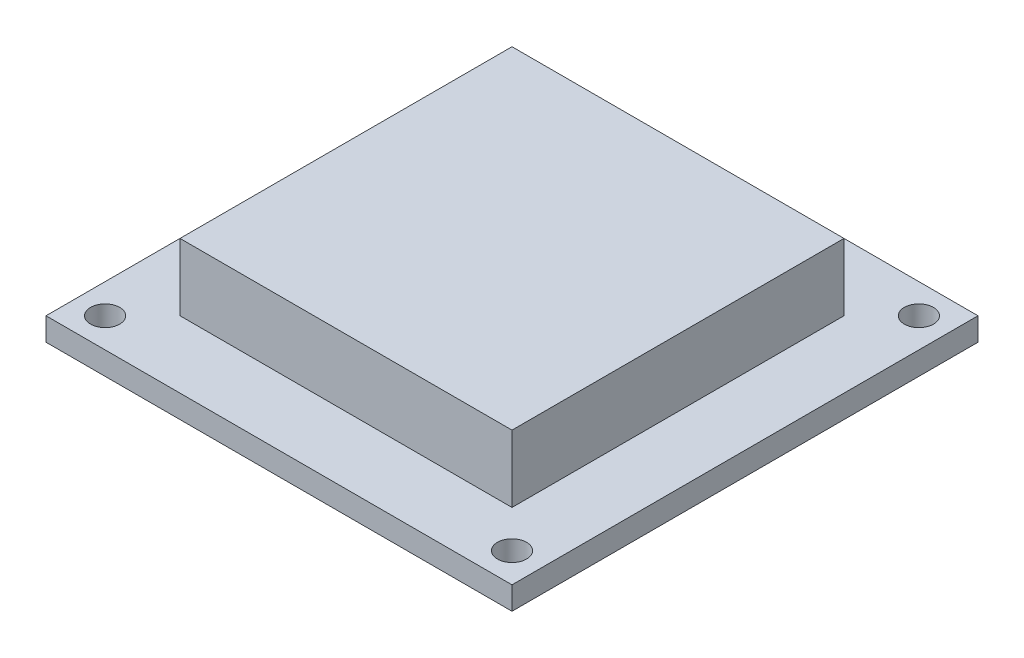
ISO-10303-21;
HEADER;
FILE_DESCRIPTION(('STEP AP214'),'2;1');
FILE_NAME('part.step','',(''),(''),'','','');
FILE_SCHEMA(('AUTOMOTIVE_DESIGN { 1 0 10303 214 1 1 1 1 }'));
ENDSEC;
DATA;
#1=APPLICATION_CONTEXT('core data for automotive mechanical design processes');
#2=APPLICATION_PROTOCOL_DEFINITION('international standard','automotive_design',2000,#1);
#3=PRODUCT_CONTEXT('',#1,'mechanical');
#4=PRODUCT('Part','Part','',(#3));
#5=PRODUCT_RELATED_PRODUCT_CATEGORY('part','',(#4));
#6=PRODUCT_DEFINITION_FORMATION('','',#4);
#7=PRODUCT_DEFINITION_CONTEXT('part definition',#1,'design');
#8=PRODUCT_DEFINITION('design','',#6,#7);
#9=PRODUCT_DEFINITION_SHAPE('','',#8);
#10=(LENGTH_UNIT() NAMED_UNIT(*) SI_UNIT(.MILLI.,.METRE.));
#11=(NAMED_UNIT(*) PLANE_ANGLE_UNIT() SI_UNIT($,.RADIAN.));
#12=(NAMED_UNIT(*) SI_UNIT($,.STERADIAN.) SOLID_ANGLE_UNIT());
#13=UNCERTAINTY_MEASURE_WITH_UNIT(LENGTH_MEASURE(1.E-05),#10,'distance_accuracy_value','');
#14=(GEOMETRIC_REPRESENTATION_CONTEXT(3) GLOBAL_UNCERTAINTY_ASSIGNED_CONTEXT((#13)) GLOBAL_UNIT_ASSIGNED_CONTEXT((#10,
#11,#12)) REPRESENTATION_CONTEXT('',''));
#15=CARTESIAN_POINT('',(0.,0.,0.));
#16=DIRECTION('',(0.,0.,1.));
#17=DIRECTION('',(1.,0.,0.));
#18=AXIS2_PLACEMENT_3D('',#15,#16,#17);
#19=CARTESIAN_POINT('',(0.,0.7874,0.));
#20=DIRECTION('',(0.,-1.,0.));
#21=DIRECTION('',(0.,0.,-1.));
#22=AXIS2_PLACEMENT_3D('',#19,#20,#21);
#23=PLANE('',#22);
#24=CARTESIAN_POINT('',(-6.985,0.7874,6.985));
#25=DIRECTION('',(0.,-1.,0.));
#26=DIRECTION('',(0.,0.,-1.));
#27=AXIS2_PLACEMENT_3D('',#24,#25,#26);
#28=CIRCLE('',#27,0.500000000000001);
#29=CARTESIAN_POINT('',(-6.985,0.7874,6.485));
#30=VERTEX_POINT('',#29);
#31=EDGE_CURVE('E307',#30,#30,#28,.T.);
#32=ORIENTED_EDGE('',*,*,#31,.T.);
#33=EDGE_LOOP('',(#32));
#34=FACE_BOUND('',#33,.T.);
#35=CARTESIAN_POINT('',(6.985,0.7874,6.985));
#36=DIRECTION('',(0.,-1.,0.));
#37=DIRECTION('',(0.,0.,-1.));
#38=AXIS2_PLACEMENT_3D('',#35,#36,#37);
#39=CIRCLE('',#38,0.500000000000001);
#40=CARTESIAN_POINT('',(6.985,0.7874,6.485));
#41=VERTEX_POINT('',#40);
#42=EDGE_CURVE('E311',#41,#41,#39,.T.);
#43=ORIENTED_EDGE('',*,*,#42,.T.);
#44=EDGE_LOOP('',(#43));
#45=FACE_BOUND('',#44,.T.);
#46=CARTESIAN_POINT('',(6.985,0.7874,-6.985));
#47=DIRECTION('',(0.,-1.,0.));
#48=DIRECTION('',(0.,0.,-1.));
#49=AXIS2_PLACEMENT_3D('',#46,#47,#48);
#50=CIRCLE('',#49,0.500000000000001);
#51=CARTESIAN_POINT('',(6.985,0.7874,-7.485));
#52=VERTEX_POINT('',#51);
#53=EDGE_CURVE('E320',#52,#52,#50,.T.);
#54=ORIENTED_EDGE('',*,*,#53,.T.);
#55=EDGE_LOOP('',(#54));
#56=FACE_BOUND('',#55,.T.);
#57=CARTESIAN_POINT('',(-6.985,0.7874,-6.985));
#58=DIRECTION('',(0.,-1.,0.));
#59=DIRECTION('',(0.,0.,-1.));
#60=AXIS2_PLACEMENT_3D('',#57,#58,#59);
#61=CIRCLE('',#60,0.500000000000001);
#62=CARTESIAN_POINT('',(-6.985,0.7874,-7.485));
#63=VERTEX_POINT('',#62);
#64=EDGE_CURVE('E326',#63,#63,#61,.T.);
#65=ORIENTED_EDGE('',*,*,#64,.T.);
#66=EDGE_LOOP('',(#65));
#67=FACE_BOUND('',#66,.T.);
#68=DIRECTION('',(0.,0.,1.));
#69=VECTOR('',#68,1.);
#70=CARTESIAN_POINT('',(-8.,0.7874,-8.));
#71=LINE('',#70,#69);
#72=CARTESIAN_POINT('',(-8.,0.7874,-8.));
#73=VERTEX_POINT('',#72);
#74=CARTESIAN_POINT('',(-8.,0.7874,8.));
#75=VERTEX_POINT('',#74);
#76=EDGE_CURVE('E128',#73,#75,#71,.T.);
#77=ORIENTED_EDGE('',*,*,#76,.T.);
#78=DIRECTION('',(1.,0.,0.));
#79=VECTOR('',#78,1.);
#80=CARTESIAN_POINT('',(8.,0.7874,8.));
#81=LINE('',#80,#79);
#82=CARTESIAN_POINT('',(8.,0.7874,8.));
#83=VERTEX_POINT('',#82);
#84=EDGE_CURVE('E131',#75,#83,#81,.T.);
#85=ORIENTED_EDGE('',*,*,#84,.T.);
#86=DIRECTION('',(0.,0.,-1.));
#87=VECTOR('',#86,1.);
#88=CARTESIAN_POINT('',(8.,0.7874,-8.));
#89=LINE('',#88,#87);
#90=CARTESIAN_POINT('',(8.,0.7874,-8.));
#91=VERTEX_POINT('',#90);
#92=EDGE_CURVE('E134',#83,#91,#89,.T.);
#93=ORIENTED_EDGE('',*,*,#92,.T.);
#94=DIRECTION('',(-1.,0.,0.));
#95=VECTOR('',#94,1.);
#96=CARTESIAN_POINT('',(8.,0.7874,-8.));
#97=LINE('',#96,#95);
#98=EDGE_CURVE('E136',#91,#73,#97,.T.);
#99=ORIENTED_EDGE('',*,*,#98,.T.);
#100=EDGE_LOOP('',(#77,#85,#93,#99));
#101=FACE_BOUND('',#100,.T.);
#102=DIRECTION('',(0.,0.,1.));
#103=VECTOR('',#102,1.);
#104=CARTESIAN_POINT('',(-5.7,0.7874,-5.7));
#105=LINE('',#104,#103);
#106=CARTESIAN_POINT('',(-5.7,0.7874,-5.7));
#107=VERTEX_POINT('',#106);
#108=CARTESIAN_POINT('',(-5.7,0.7874,5.7));
#109=VERTEX_POINT('',#108);
#110=EDGE_CURVE('E118',#107,#109,#105,.T.);
#111=ORIENTED_EDGE('',*,*,#110,.F.);
#112=DIRECTION('',(-1.,0.,0.));
#113=VECTOR('',#112,1.);
#114=CARTESIAN_POINT('',(5.7,0.7874,-5.7));
#115=LINE('',#114,#113);
#116=CARTESIAN_POINT('',(5.7,0.7874,-5.7));
#117=VERTEX_POINT('',#116);
#118=EDGE_CURVE('E115',#117,#107,#115,.T.);
#119=ORIENTED_EDGE('',*,*,#118,.F.);
#120=DIRECTION('',(0.,0.,-1.));
#121=VECTOR('',#120,1.);
#122=CARTESIAN_POINT('',(5.7,0.7874,-5.7));
#123=LINE('',#122,#121);
#124=CARTESIAN_POINT('',(5.7,0.7874,5.7));
#125=VERTEX_POINT('',#124);
#126=EDGE_CURVE('E53',#125,#117,#123,.T.);
#127=ORIENTED_EDGE('',*,*,#126,.F.);
#128=DIRECTION('',(1.,0.,0.));
#129=VECTOR('',#128,1.);
#130=CARTESIAN_POINT('',(5.7,0.7874,5.7));
#131=LINE('',#130,#129);
#132=EDGE_CURVE('E48',#109,#125,#131,.T.);
#133=ORIENTED_EDGE('',*,*,#132,.F.);
#134=EDGE_LOOP('',(#111,#119,#127,#133));
#135=FACE_BOUND('',#134,.T.);
#136=ADVANCED_FACE('F33',(#34,#45,#56,#67,#101,#135),#23,.F.);
#137=CARTESIAN_POINT('',(-8.,0.7874,-8.));
#138=DIRECTION('',(1.,0.,0.));
#139=DIRECTION('',(0.,0.,-1.));
#140=AXIS2_PLACEMENT_3D('',#137,#138,#139);
#141=PLANE('',#140);
#142=DIRECTION('',(0.,0.,1.));
#143=VECTOR('',#142,1.);
#144=CARTESIAN_POINT('',(-8.,0.,-8.));
#145=LINE('',#144,#143);
#146=CARTESIAN_POINT('',(-8.,0.,-8.));
#147=VERTEX_POINT('',#146);
#148=CARTESIAN_POINT('',(-8.,0.,8.));
#149=VERTEX_POINT('',#148);
#150=EDGE_CURVE('E119',#147,#149,#145,.T.);
#151=ORIENTED_EDGE('',*,*,#150,.T.);
#152=DIRECTION('',(0.,-1.,0.));
#153=VECTOR('',#152,1.);
#154=CARTESIAN_POINT('',(-8.,0.7874,8.));
#155=LINE('',#154,#153);
#156=EDGE_CURVE('E11',#75,#149,#155,.T.);
#157=ORIENTED_EDGE('',*,*,#156,.F.);
#158=ORIENTED_EDGE('',*,*,#76,.F.);
#159=DIRECTION('',(0.,-1.,0.));
#160=VECTOR('',#159,1.);
#161=CARTESIAN_POINT('',(-8.,0.7874,-8.));
#162=LINE('',#161,#160);
#163=EDGE_CURVE('E137',#73,#147,#162,.T.);
#164=ORIENTED_EDGE('',*,*,#163,.T.);
#165=EDGE_LOOP('',(#151,#157,#158,#164));
#166=FACE_BOUND('',#165,.T.);
#167=ADVANCED_FACE('F35',(#166),#141,.F.);
#168=CARTESIAN_POINT('',(8.,0.7874,8.));
#169=DIRECTION('',(0.,0.,-1.));
#170=DIRECTION('',(-1.,0.,0.));
#171=AXIS2_PLACEMENT_3D('',#168,#169,#170);
#172=PLANE('',#171);
#173=DIRECTION('',(1.,0.,0.));
#174=VECTOR('',#173,1.);
#175=CARTESIAN_POINT('',(8.,0.,8.));
#176=LINE('',#175,#174);
#177=CARTESIAN_POINT('',(8.,0.,8.));
#178=VERTEX_POINT('',#177);
#179=EDGE_CURVE('E122',#149,#178,#176,.T.);
#180=ORIENTED_EDGE('',*,*,#179,.T.);
#181=DIRECTION('',(0.,-1.,0.));
#182=VECTOR('',#181,1.);
#183=CARTESIAN_POINT('',(8.,0.7874,8.));
#184=LINE('',#183,#182);
#185=EDGE_CURVE('E41',#83,#178,#184,.T.);
#186=ORIENTED_EDGE('',*,*,#185,.F.);
#187=ORIENTED_EDGE('',*,*,#84,.F.);
#188=ORIENTED_EDGE('',*,*,#156,.T.);
#189=EDGE_LOOP('',(#180,#186,#187,#188));
#190=FACE_BOUND('',#189,.T.);
#191=ADVANCED_FACE('F167',(#190),#172,.F.);
#192=CARTESIAN_POINT('',(8.,0.7874,-8.));
#193=DIRECTION('',(-1.,0.,0.));
#194=DIRECTION('',(0.,0.,1.));
#195=AXIS2_PLACEMENT_3D('',#192,#193,#194);
#196=PLANE('',#195);
#197=DIRECTION('',(0.,0.,-1.));
#198=VECTOR('',#197,1.);
#199=CARTESIAN_POINT('',(8.,0.,-8.));
#200=LINE('',#199,#198);
#201=CARTESIAN_POINT('',(8.,0.,-8.));
#202=VERTEX_POINT('',#201);
#203=EDGE_CURVE('E140',#178,#202,#200,.T.);
#204=ORIENTED_EDGE('',*,*,#203,.T.);
#205=DIRECTION('',(0.,-1.,0.));
#206=VECTOR('',#205,1.);
#207=CARTESIAN_POINT('',(8.,0.7874,-8.));
#208=LINE('',#207,#206);
#209=EDGE_CURVE('E145',#91,#202,#208,.T.);
#210=ORIENTED_EDGE('',*,*,#209,.F.);
#211=ORIENTED_EDGE('',*,*,#92,.F.);
#212=ORIENTED_EDGE('',*,*,#185,.T.);
#213=EDGE_LOOP('',(#204,#210,#211,#212));
#214=FACE_BOUND('',#213,.T.);
#215=ADVANCED_FACE('F152',(#214),#196,.F.);
#216=CARTESIAN_POINT('',(8.,0.7874,-8.));
#217=DIRECTION('',(0.,0.,1.));
#218=DIRECTION('',(1.,0.,0.));
#219=AXIS2_PLACEMENT_3D('',#216,#217,#218);
#220=PLANE('',#219);
#221=DIRECTION('',(-1.,0.,0.));
#222=VECTOR('',#221,1.);
#223=CARTESIAN_POINT('',(8.,0.,-8.));
#224=LINE('',#223,#222);
#225=EDGE_CURVE('E132',#202,#147,#224,.T.);
#226=ORIENTED_EDGE('',*,*,#225,.T.);
#227=ORIENTED_EDGE('',*,*,#163,.F.);
#228=ORIENTED_EDGE('',*,*,#98,.F.);
#229=ORIENTED_EDGE('',*,*,#209,.T.);
#230=EDGE_LOOP('',(#226,#227,#228,#229));
#231=FACE_BOUND('',#230,.T.);
#232=ADVANCED_FACE('F161',(#231),#220,.F.);
#233=CARTESIAN_POINT('',(0.,0.,0.));
#234=DIRECTION('',(0.,-1.,0.));
#235=DIRECTION('',(0.,0.,-1.));
#236=AXIS2_PLACEMENT_3D('',#233,#234,#235);
#237=PLANE('',#236);
#238=CARTESIAN_POINT('',(-6.985,0.,6.985));
#239=DIRECTION('',(0.,-1.,0.));
#240=DIRECTION('',(0.,0.,-1.));
#241=AXIS2_PLACEMENT_3D('',#238,#239,#240);
#242=CIRCLE('',#241,0.500000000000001);
#243=CARTESIAN_POINT('',(-6.985,0.,6.485));
#244=VERTEX_POINT('',#243);
#245=EDGE_CURVE('E305',#244,#244,#242,.T.);
#246=ORIENTED_EDGE('',*,*,#245,.F.);
#247=EDGE_LOOP('',(#246));
#248=FACE_BOUND('',#247,.T.);
#249=CARTESIAN_POINT('',(6.985,0.,6.985));
#250=DIRECTION('',(0.,-1.,0.));
#251=DIRECTION('',(0.,0.,-1.));
#252=AXIS2_PLACEMENT_3D('',#249,#250,#251);
#253=CIRCLE('',#252,0.500000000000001);
#254=CARTESIAN_POINT('',(6.985,0.,6.485));
#255=VERTEX_POINT('',#254);
#256=EDGE_CURVE('E308',#255,#255,#253,.T.);
#257=ORIENTED_EDGE('',*,*,#256,.F.);
#258=EDGE_LOOP('',(#257));
#259=FACE_BOUND('',#258,.T.);
#260=CARTESIAN_POINT('',(6.985,0.,-6.985));
#261=DIRECTION('',(0.,-1.,0.));
#262=DIRECTION('',(0.,0.,-1.));
#263=AXIS2_PLACEMENT_3D('',#260,#261,#262);
#264=CIRCLE('',#263,0.500000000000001);
#265=CARTESIAN_POINT('',(6.985,0.,-7.485));
#266=VERTEX_POINT('',#265);
#267=EDGE_CURVE('E317',#266,#266,#264,.T.);
#268=ORIENTED_EDGE('',*,*,#267,.F.);
#269=EDGE_LOOP('',(#268));
#270=FACE_BOUND('',#269,.T.);
#271=CARTESIAN_POINT('',(-6.985,0.,-6.985));
#272=DIRECTION('',(0.,-1.,0.));
#273=DIRECTION('',(0.,0.,-1.));
#274=AXIS2_PLACEMENT_3D('',#271,#272,#273);
#275=CIRCLE('',#274,0.500000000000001);
#276=CARTESIAN_POINT('',(-6.985,0.,-7.485));
#277=VERTEX_POINT('',#276);
#278=EDGE_CURVE('E323',#277,#277,#275,.T.);
#279=ORIENTED_EDGE('',*,*,#278,.F.);
#280=EDGE_LOOP('',(#279));
#281=FACE_BOUND('',#280,.T.);
#282=ORIENTED_EDGE('',*,*,#150,.F.);
#283=ORIENTED_EDGE('',*,*,#225,.F.);
#284=ORIENTED_EDGE('',*,*,#203,.F.);
#285=ORIENTED_EDGE('',*,*,#179,.F.);
#286=EDGE_LOOP('',(#282,#283,#284,#285));
#287=FACE_BOUND('',#286,.T.);
#288=ADVANCED_FACE('F158',(#248,#259,#270,#281,#287),#237,.T.);
#289=CARTESIAN_POINT('',(-5.7,3.0874,-5.7));
#290=DIRECTION('',(1.,0.,0.));
#291=DIRECTION('',(0.,0.,-1.));
#292=AXIS2_PLACEMENT_3D('',#289,#290,#291);
#293=PLANE('',#292);
#294=ORIENTED_EDGE('',*,*,#110,.T.);
#295=DIRECTION('',(0.,-1.,0.));
#296=VECTOR('',#295,1.);
#297=CARTESIAN_POINT('',(-5.7,3.0874,5.7));
#298=LINE('',#297,#296);
#299=CARTESIAN_POINT('',(-5.7,3.0874,5.7));
#300=VERTEX_POINT('',#299);
#301=EDGE_CURVE('E99',#300,#109,#298,.T.);
#302=ORIENTED_EDGE('',*,*,#301,.F.);
#303=DIRECTION('',(0.,0.,1.));
#304=VECTOR('',#303,1.);
#305=CARTESIAN_POINT('',(-5.7,3.0874,-5.7));
#306=LINE('',#305,#304);
#307=CARTESIAN_POINT('',(-5.7,3.0874,-5.7));
#308=VERTEX_POINT('',#307);
#309=EDGE_CURVE('E106',#308,#300,#306,.T.);
#310=ORIENTED_EDGE('',*,*,#309,.F.);
#311=DIRECTION('',(0.,-1.,0.));
#312=VECTOR('',#311,1.);
#313=CARTESIAN_POINT('',(-5.7,3.0874,-5.7));
#314=LINE('',#313,#312);
#315=EDGE_CURVE('E331',#308,#107,#314,.T.);
#316=ORIENTED_EDGE('',*,*,#315,.T.);
#317=EDGE_LOOP('',(#294,#302,#310,#316));
#318=FACE_BOUND('',#317,.T.);
#319=ADVANCED_FACE('F117',(#318),#293,.F.);
#320=CARTESIAN_POINT('',(5.7,3.0874,5.7));
#321=DIRECTION('',(0.,0.,-1.));
#322=DIRECTION('',(-1.,0.,0.));
#323=AXIS2_PLACEMENT_3D('',#320,#321,#322);
#324=PLANE('',#323);
#325=ORIENTED_EDGE('',*,*,#132,.T.);
#326=DIRECTION('',(0.,-1.,0.));
#327=VECTOR('',#326,1.);
#328=CARTESIAN_POINT('',(5.7,3.0874,5.7));
#329=LINE('',#328,#327);
#330=CARTESIAN_POINT('',(5.7,3.0874,5.7));
#331=VERTEX_POINT('',#330);
#332=EDGE_CURVE('E102',#331,#125,#329,.T.);
#333=ORIENTED_EDGE('',*,*,#332,.F.);
#334=DIRECTION('',(1.,0.,0.));
#335=VECTOR('',#334,1.);
#336=CARTESIAN_POINT('',(5.7,3.0874,5.7));
#337=LINE('',#336,#335);
#338=EDGE_CURVE('E95',#300,#331,#337,.T.);
#339=ORIENTED_EDGE('',*,*,#338,.F.);
#340=ORIENTED_EDGE('',*,*,#301,.T.);
#341=EDGE_LOOP('',(#325,#333,#339,#340));
#342=FACE_BOUND('',#341,.T.);
#343=ADVANCED_FACE('F97',(#342),#324,.F.);
#344=CARTESIAN_POINT('',(5.7,3.0874,-5.7));
#345=DIRECTION('',(-1.,0.,0.));
#346=DIRECTION('',(0.,0.,1.));
#347=AXIS2_PLACEMENT_3D('',#344,#345,#346);
#348=PLANE('',#347);
#349=ORIENTED_EDGE('',*,*,#126,.T.);
#350=DIRECTION('',(0.,-1.,0.));
#351=VECTOR('',#350,1.);
#352=CARTESIAN_POINT('',(5.7,3.0874,-5.7));
#353=LINE('',#352,#351);
#354=CARTESIAN_POINT('',(5.7,3.0874,-5.7));
#355=VERTEX_POINT('',#354);
#356=EDGE_CURVE('E124',#355,#117,#353,.T.);
#357=ORIENTED_EDGE('',*,*,#356,.F.);
#358=DIRECTION('',(0.,0.,-1.));
#359=VECTOR('',#358,1.);
#360=CARTESIAN_POINT('',(5.7,3.0874,-5.7));
#361=LINE('',#360,#359);
#362=EDGE_CURVE('E105',#331,#355,#361,.T.);
#363=ORIENTED_EDGE('',*,*,#362,.F.);
#364=ORIENTED_EDGE('',*,*,#332,.T.);
#365=EDGE_LOOP('',(#349,#357,#363,#364));
#366=FACE_BOUND('',#365,.T.);
#367=ADVANCED_FACE('F208',(#366),#348,.F.);
#368=CARTESIAN_POINT('',(5.7,3.0874,-5.7));
#369=DIRECTION('',(0.,0.,1.));
#370=DIRECTION('',(1.,0.,0.));
#371=AXIS2_PLACEMENT_3D('',#368,#369,#370);
#372=PLANE('',#371);
#373=ORIENTED_EDGE('',*,*,#118,.T.);
#374=ORIENTED_EDGE('',*,*,#315,.F.);
#375=DIRECTION('',(-1.,0.,0.));
#376=VECTOR('',#375,1.);
#377=CARTESIAN_POINT('',(5.7,3.0874,-5.7));
#378=LINE('',#377,#376);
#379=EDGE_CURVE('E111',#355,#308,#378,.T.);
#380=ORIENTED_EDGE('',*,*,#379,.F.);
#381=ORIENTED_EDGE('',*,*,#356,.T.);
#382=EDGE_LOOP('',(#373,#374,#380,#381));
#383=FACE_BOUND('',#382,.T.);
#384=ADVANCED_FACE('F214',(#383),#372,.F.);
#385=CARTESIAN_POINT('',(0.,3.0874,0.));
#386=DIRECTION('',(0.,-1.,0.));
#387=DIRECTION('',(0.,0.,-1.));
#388=AXIS2_PLACEMENT_3D('',#385,#386,#387);
#389=PLANE('',#388);
#390=ORIENTED_EDGE('',*,*,#309,.T.);
#391=ORIENTED_EDGE('',*,*,#338,.T.);
#392=ORIENTED_EDGE('',*,*,#362,.T.);
#393=ORIENTED_EDGE('',*,*,#379,.T.);
#394=EDGE_LOOP('',(#390,#391,#392,#393));
#395=FACE_BOUND('',#394,.T.);
#396=ADVANCED_FACE('F109',(#395),#389,.F.);
#397=CARTESIAN_POINT('',(-6.985,3.0874,-6.985));
#398=DIRECTION('',(0.,-1.,0.));
#399=DIRECTION('',(0.,0.,-1.));
#400=AXIS2_PLACEMENT_3D('',#397,#398,#399);
#401=CYLINDRICAL_SURFACE('',#400,0.500000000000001);
#402=ORIENTED_EDGE('',*,*,#278,.T.);
#403=EDGE_LOOP('',(#402));
#404=FACE_BOUND('',#403,.T.);
#405=ORIENTED_EDGE('',*,*,#64,.F.);
#406=EDGE_LOOP('',(#405));
#407=FACE_BOUND('',#406,.T.);
#408=ADVANCED_FACE('F229',(#404,#407),#401,.F.);
#409=CARTESIAN_POINT('',(6.985,3.0874,-6.985));
#410=DIRECTION('',(0.,-1.,0.));
#411=DIRECTION('',(0.,0.,-1.));
#412=AXIS2_PLACEMENT_3D('',#409,#410,#411);
#413=CYLINDRICAL_SURFACE('',#412,0.500000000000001);
#414=ORIENTED_EDGE('',*,*,#267,.T.);
#415=EDGE_LOOP('',(#414));
#416=FACE_BOUND('',#415,.T.);
#417=ORIENTED_EDGE('',*,*,#53,.F.);
#418=EDGE_LOOP('',(#417));
#419=FACE_BOUND('',#418,.T.);
#420=ADVANCED_FACE('F235',(#416,#419),#413,.F.);
#421=CARTESIAN_POINT('',(6.985,3.0874,6.985));
#422=DIRECTION('',(0.,-1.,0.));
#423=DIRECTION('',(0.,0.,-1.));
#424=AXIS2_PLACEMENT_3D('',#421,#422,#423);
#425=CYLINDRICAL_SURFACE('',#424,0.500000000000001);
#426=ORIENTED_EDGE('',*,*,#256,.T.);
#427=EDGE_LOOP('',(#426));
#428=FACE_BOUND('',#427,.T.);
#429=ORIENTED_EDGE('',*,*,#42,.F.);
#430=EDGE_LOOP('',(#429));
#431=FACE_BOUND('',#430,.T.);
#432=ADVANCED_FACE('F243',(#428,#431),#425,.F.);
#433=CARTESIAN_POINT('',(-6.985,3.0874,6.985));
#434=DIRECTION('',(0.,-1.,0.));
#435=DIRECTION('',(0.,0.,-1.));
#436=AXIS2_PLACEMENT_3D('',#433,#434,#435);
#437=CYLINDRICAL_SURFACE('',#436,0.500000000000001);
#438=ORIENTED_EDGE('',*,*,#245,.T.);
#439=EDGE_LOOP('',(#438));
#440=FACE_BOUND('',#439,.T.);
#441=ORIENTED_EDGE('',*,*,#31,.F.);
#442=EDGE_LOOP('',(#441));
#443=FACE_BOUND('',#442,.T.);
#444=ADVANCED_FACE('F251',(#440,#443),#437,.F.);
#445=CLOSED_SHELL('',(#136,#167,#191,#215,#232,#288,#319,#343,#367,#384,#396,#408,#420,#432,#444));
#446=MANIFOLD_SOLID_BREP('B2',#445);
#447=ADVANCED_BREP_SHAPE_REPRESENTATION('',(#18,#446),#14);
#448=SHAPE_DEFINITION_REPRESENTATION(#9,#447);
ENDSEC;
END-ISO-10303-21;
